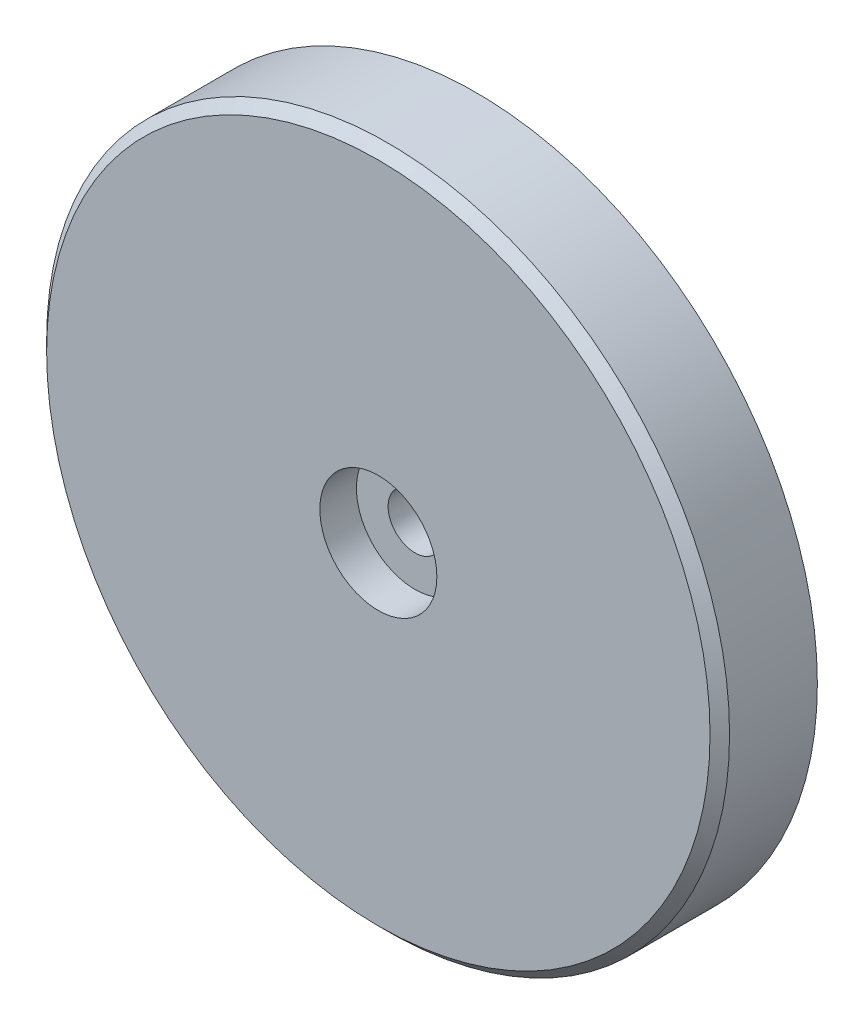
from build123d import *

# Parameters (mm, degrees)
ESQUISSE1_R                                        = 70
EXTRUSION1_DEPTH                                   = 20
CHANFREIN1_SIZE                                    = 2
ESQUISSE6_R                                        = 20
EXTRUSION2_DEPTH                                   = 5
CHANFREIN2_SIZE                                    = 1
CHAMBRAGE_POUR_VIS_T_TE_RONDE_BOMB_E_M_D           = 11
CHAMBRAGE_POUR_VIS_T_TE_RONDE_BOMB_E_M_CBORE_D     = 24
CHAMBRAGE_POUR_VIS_T_TE_RONDE_BOMB_E_M_CBORE_DEPTH = 7.5


with BuildPart() as part:
    # Esquisse1 → Extrusion1 (new body)
    with BuildSketch(Plane.XY):
        Circle(ESQUISSE1_R)
    extrude(amount=EXTRUSION1_DEPTH)

    # Chanfrein1
    chanfrein1_edges = [part.edges().sort_by_distance(p)[0] for p in [
        (-70, 0, 20),
    ]]
    chamfer(chanfrein1_edges, length=CHANFREIN1_SIZE)

    # Esquisse6 → Extrusion2 (add)
    with BuildSketch(Plane(origin=(0, 0, 0), x_dir=(-1, 0, 0), z_dir=(0, 0, -1))):
        with Locations(Location((0, 0, 0), (0, 0, 180))):
            Circle(ESQUISSE6_R)
    extrude(amount=EXTRUSION2_DEPTH)

    # Chanfrein2
    chanfrein2_edges = [part.edges().sort_by_distance(p)[0] for p in [
        (-20, 0, -5),
    ]]
    chamfer(chanfrein2_edges, length=CHANFREIN2_SIZE)

    # Chambrage pour vis _ t_te ronde bomb_e M (through all)
    with Locations(Plane.XY.offset(20)):
        with Locations((0, 0)):
            CounterBoreHole(CHAMBRAGE_POUR_VIS_T_TE_RONDE_BOMB_E_M_D / 2, CHAMBRAGE_POUR_VIS_T_TE_RONDE_BOMB_E_M_CBORE_D / 2, CHAMBRAGE_POUR_VIS_T_TE_RONDE_BOMB_E_M_CBORE_DEPTH)


solid = part.part
